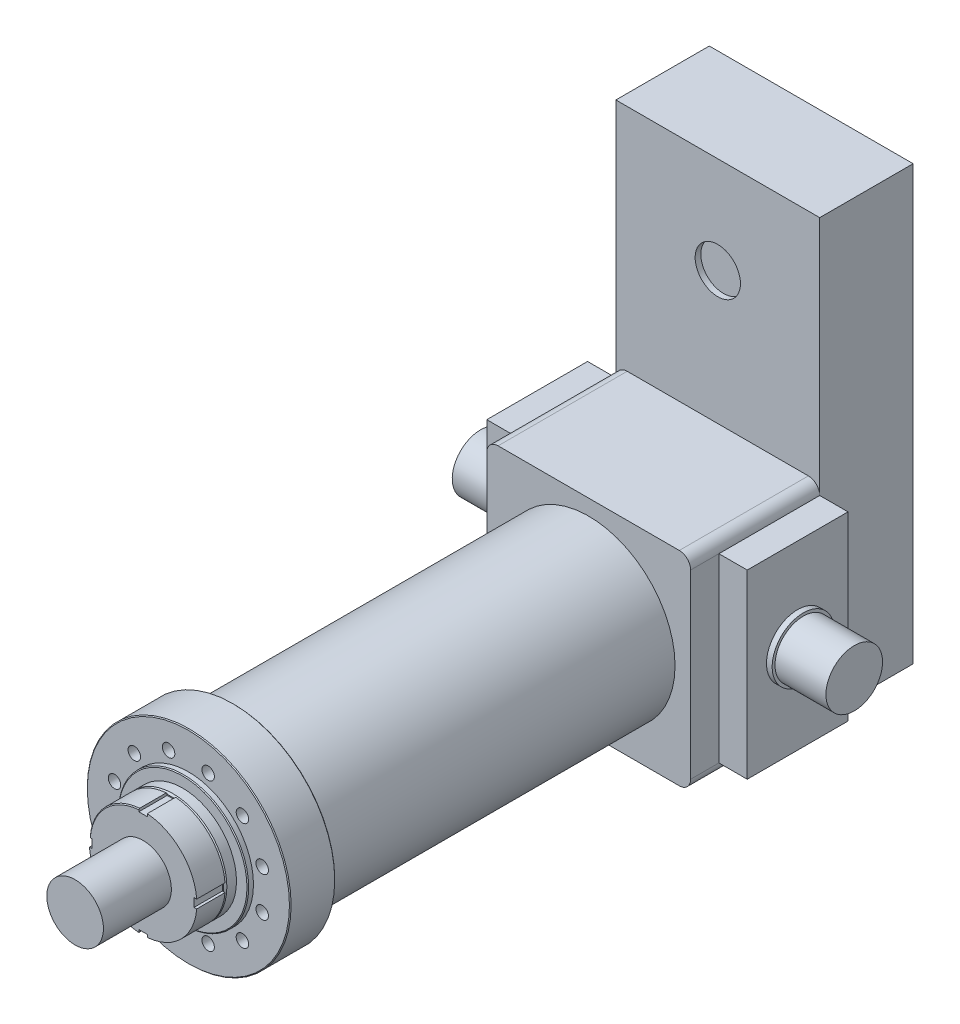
from build123d import *

# Parameters (mm, degrees)
SKETCH_1_R          = 152.5
EXTRUDE_1_DEPTH     = 627
SKETCH_2_R          = 180
SKETCH_2_R_2        = 11
EXTRUDE_2_DEPTH     = 80
SKETCH_3_R          = 115
EXTRUDE_3_DEPTH     = 10
SKETCH_4_R          = 95
EXTRUDE_4_DEPTH     = 20
CHAMFER_1_SIZE      = 3
EXTRUDE_5_DEPTH     = 50
CHAMFER_2_SIZE      = 1.5
SKETCH_11_W         = 360
SKETCH_11_H         = 360
EXTRUDE_10_DEPTH    = 50
SKETCH_16_R         = 16
CUT_EXTRUDE_4_DEPTH = 2
SKETCH_19_R         = 50
EXTRUDE_12_DEPTH    = 120
SKETCH_21_W         = 360
SKETCH_21_H         = 360
EXTRUDE_14_DEPTH    = 178
SKETCH_22_W         = 360
SKETCH_22_H         = 765
EXTRUDE_16_DEPTH    = 165
SKETCH_23_R         = 40
CUT_EXTRUDE_5_DEPTH = 10
FILLET_1_R          = 20
FILLET_2_R          = 20
SKETCH_24_W         = 178
SKETCH_24_H         = 320
EXTRUDE_17_DEPTH    = 50
EXTRUDE_START       = -360
SKETCH_24_2_W       = 178
SKETCH_24_2_H       = 320
EXTRUDE_18_DEPTH    = 50
SKETCH_25_R         = 50
EXTRUDE_19_DEPTH    = 100
EXTRUDE_START_2     = -560
SKETCH_25_2_R       = 50
EXTRUDE_20_DEPTH    = 100
SKETCH_26_R         = 55
SKETCH_26_R_2       = 50
EXTRUDE_21_DEPTH    = 10
EXTRUDE_START_3     = -470
SKETCH_26_2_R       = 55
SKETCH_26_2_R_2     = 50
EXTRUDE_22_DEPTH    = 10


with BuildPart() as part:
    # Sketch 1 → Extrude 1 (new body)
    with BuildSketch(Plane.XY):
        Circle(SKETCH_1_R)
    extrude(amount=EXTRUDE_1_DEPTH)

    # Sketch 2 → Extrude 2 (add)
    with BuildSketch(Plane.XY.offset(627)):
        Circle(SKETCH_2_R)
        with Locations((130.399986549, 34.940571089)):
            Circle(SKETCH_2_R_2, mode=Mode.SUBTRACT)
        with Locations((130.399986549, -34.940571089)):
            Circle(SKETCH_2_R_2, mode=Mode.SUBTRACT)
        with Locations((95.45941546, -95.45941546)):
            Circle(SKETCH_2_R_2, mode=Mode.SUBTRACT)
        with Locations((34.940571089, -130.399986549)):
            Circle(SKETCH_2_R_2, mode=Mode.SUBTRACT)
        with Locations((-34.940571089, -130.399986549)):
            Circle(SKETCH_2_R_2, mode=Mode.SUBTRACT)
        with Locations((-95.45941546, -95.45941546)):
            Circle(SKETCH_2_R_2, mode=Mode.SUBTRACT)
        with Locations((-130.399986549, -34.940571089)):
            Circle(SKETCH_2_R_2, mode=Mode.SUBTRACT)
        with Locations((-130.399986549, 34.940571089)):
            Circle(SKETCH_2_R_2, mode=Mode.SUBTRACT)
        with Locations((-95.45941546, 95.45941546)):
            Circle(SKETCH_2_R_2, mode=Mode.SUBTRACT)
        with Locations((-34.940571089, 130.399986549)):
            Circle(SKETCH_2_R_2, mode=Mode.SUBTRACT)
        with Locations((34.940571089, 130.399986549)):
            Circle(SKETCH_2_R_2, mode=Mode.SUBTRACT)
        with Locations((95.45941546, 95.45941546)):
            Circle(SKETCH_2_R_2, mode=Mode.SUBTRACT)
    extrude(amount=EXTRUDE_2_DEPTH)

    # Sketch 3 → Extrude 3 (add)
    with BuildSketch(Plane.XY.offset(707)):
        Circle(SKETCH_3_R)
    extrude(amount=EXTRUDE_3_DEPTH)

    # Sketch 4 → Extrude 4 (add)
    with BuildSketch(Plane.XY.offset(717)):
        Circle(SKETCH_4_R)
    extrude(amount=EXTRUDE_4_DEPTH)

    # Chamfer 1
    chamfer_1_edges = [part.edges().sort_by_distance(p)[0] for p in [
        (-95, 0, 737),
    ]]
    chamfer(chamfer_1_edges, length=CHAMFER_1_SIZE)

    # Sketch 5 → Extrude 5 (add)
    with BuildSketch(Plane.XY.offset(737)):
        with BuildLine():
            Line((-7.5, 94.703484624), (-7.5, 90))
            Line((-7.5, 90), (7.5, 90))
            Line((7.5, 90), (7.5, 94.703484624))
            ThreePointArc((7.5, 94.703484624), (67.175144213, 67.175144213), (94.703484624, 7.5))
            Line((94.703484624, 7.5), (90, 7.5))
            Line((90, 7.5), (90, -7.5))
            Line((90, -7.5), (94.703484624, -7.5))
            ThreePointArc((94.703484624, -7.5), (67.175144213, -67.175144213), (7.5, -94.703484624))
            Line((7.5, -94.703484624), (7.5, -90))
            Line((7.5, -90), (-7.5, -90))
            Line((-7.5, -90), (-7.5, -94.703484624))
            ThreePointArc((-7.5, -94.703484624), (-67.175144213, -67.175144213), (-94.703484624, -7.5))
            Line((-94.703484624, -7.5), (-90, -7.5))
            Line((-90, -7.5), (-90, 7.5))
            Line((-90, 7.5), (-94.703484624, 7.5))
            ThreePointArc((-94.703484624, 7.5), (-67.175144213, 67.175144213), (-7.5, 94.703484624))
        make_face()
    extrude(amount=EXTRUDE_5_DEPTH)

    # Chamfer 2
    chamfer_2_edges = [part.edges().sort_by_distance(p)[0] for p in [
        (-180, 0, 707),
        (-180, 0, 627),
        (-115, 0, 717),
        (-67.175144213, 67.175144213, 737),
        (-67.175144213, 67.175144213, 787),
    ]]
    chamfer(chamfer_2_edges, length=CHAMFER_2_SIZE)

    # Sketch 11 → Extrude 10 (add)
    with BuildSketch(Plane(origin=(0, 0, 0), x_dir=(-1, 0, 0), z_dir=(0, 0, -1))):
        Rectangle(SKETCH_11_W, SKETCH_11_H)
    extrude(amount=EXTRUDE_10_DEPTH)

    # Sketch 16 → Cut-Extrude 4 (cut)
    with BuildSketch(Plane(origin=(-152.5, 0, 0), x_dir=(0, 0, -1), z_dir=(1, 0, 0))):
        with Locations(Location((-27, 0, 0), (0, 0, 180))):
            Circle(SKETCH_16_R)
        with Locations(Location((-551.5, 0, 0), (0, 0, 180))):
            Circle(SKETCH_16_R)
    extrude(amount=CUT_EXTRUDE_4_DEPTH, mode=Mode.SUBTRACT)

    # Sketch 19 → Extrude 12 (add)
    with BuildSketch(Plane.XY.offset(787)):
        Circle(SKETCH_19_R)
    extrude(amount=EXTRUDE_12_DEPTH)

    # Fillet 2
    fillet_2_edges = [part.edges().sort_by_distance(p)[0] for p in [
        (-180, -180, -25),
        (-180, 180, -25),
        (180, 180, -25),
        (180, -180, -25),
    ]]
    fillet(fillet_2_edges, radius=FILLET_2_R)



with BuildPart() as body_2:
    # Sketch 21 → Extrude 14 (new body)
    with BuildSketch(Plane(origin=(0, 0, -50), x_dir=(-1, 0, 0), z_dir=(0, 0, -1))):
        Rectangle(SKETCH_21_W, SKETCH_21_H)
    extrude(amount=EXTRUDE_14_DEPTH)

    # Fillet 1
    fillet_1_edges = [body_2.edges().sort_by_distance(p)[0] for p in [
        (-180, -180, -139),
        (180, -180, -139),
        (180, 180, -139),
        (-180, 180, -139),
    ]]
    fillet(fillet_1_edges, radius=FILLET_1_R)


with BuildPart() as body_3:
    # Sketch 22 → Extrude 16 (new body)
    with BuildSketch(Plane(origin=(0, 0, -228), x_dir=(-1, 0, 0), z_dir=(0, 0, -1))):
        with Locations((0, 202.5)):
            Rectangle(SKETCH_22_W, SKETCH_22_H)
    extrude(amount=EXTRUDE_16_DEPTH)

    # Sketch 23 → Cut-Extrude 5 (cut)
    with BuildSketch(Plane.XY.offset(-228)):
        with Locations((0, 414)):
            Circle(SKETCH_23_R)
    extrude(amount=-CUT_EXTRUDE_5_DEPTH, mode=Mode.SUBTRACT)


with BuildPart() as part_1:
    add(part.part)

    add(body_2.part)  # Extrude 17 merges body 2

    add(body_3.part)  # Extrude 17 merges body 3
    # Sketch 24 → Extrude 17 (add)
    with BuildSketch(Plane.ZY.offset(180)):
        with Locations((-139, 0)):
            Rectangle(SKETCH_24_W, SKETCH_24_H)
    extrude(amount=EXTRUDE_17_DEPTH)

    # Sketch 24_2 → Extrude 18 (add)
    with BuildSketch(Plane.ZY.offset(180).offset(EXTRUDE_START)):
        with Locations((-139, 0)):
            Rectangle(SKETCH_24_2_W, SKETCH_24_2_H)
    extrude(amount=-EXTRUDE_18_DEPTH)

    # Sketch 25 → Extrude 19 (add)
    with BuildSketch(Plane.ZY.offset(230)):
        with Locations(Location((-139, 0, 0), (0, 0, 270))):
            Circle(SKETCH_25_R)
    extrude(amount=EXTRUDE_19_DEPTH)

    # Sketch 25_2 → Extrude 20 (add)
    with BuildSketch(Plane.ZY.offset(230).offset(EXTRUDE_START_2)):
        with Locations(Location((-139, 0, 0), (0, 0, 270))):
            Circle(SKETCH_25_2_R)
    extrude(amount=EXTRUDE_20_DEPTH)

    # Sketch 26 → Extrude 21 (add)
    with BuildSketch(Plane.ZY.offset(230)):
        with Locations(Location((-139, 0, 0), (0, 0, 270))):
            Circle(SKETCH_26_R)
        with Locations(Location((-139, 0, 0), (0, 0, 270))):
            Circle(SKETCH_26_R_2, mode=Mode.SUBTRACT)
    extrude(amount=EXTRUDE_21_DEPTH)

    # Sketch 26_2 → Extrude 22 (add)
    with BuildSketch(Plane.ZY.offset(230).offset(EXTRUDE_START_3)):
        with Locations(Location((-139, 0, 0), (0, 0, 270))):
            Circle(SKETCH_26_2_R)
        with Locations(Location((-139, 0, 0), (0, 0, 270))):
            Circle(SKETCH_26_2_R_2, mode=Mode.SUBTRACT)
    extrude(amount=EXTRUDE_22_DEPTH)


solid = part_1.part
